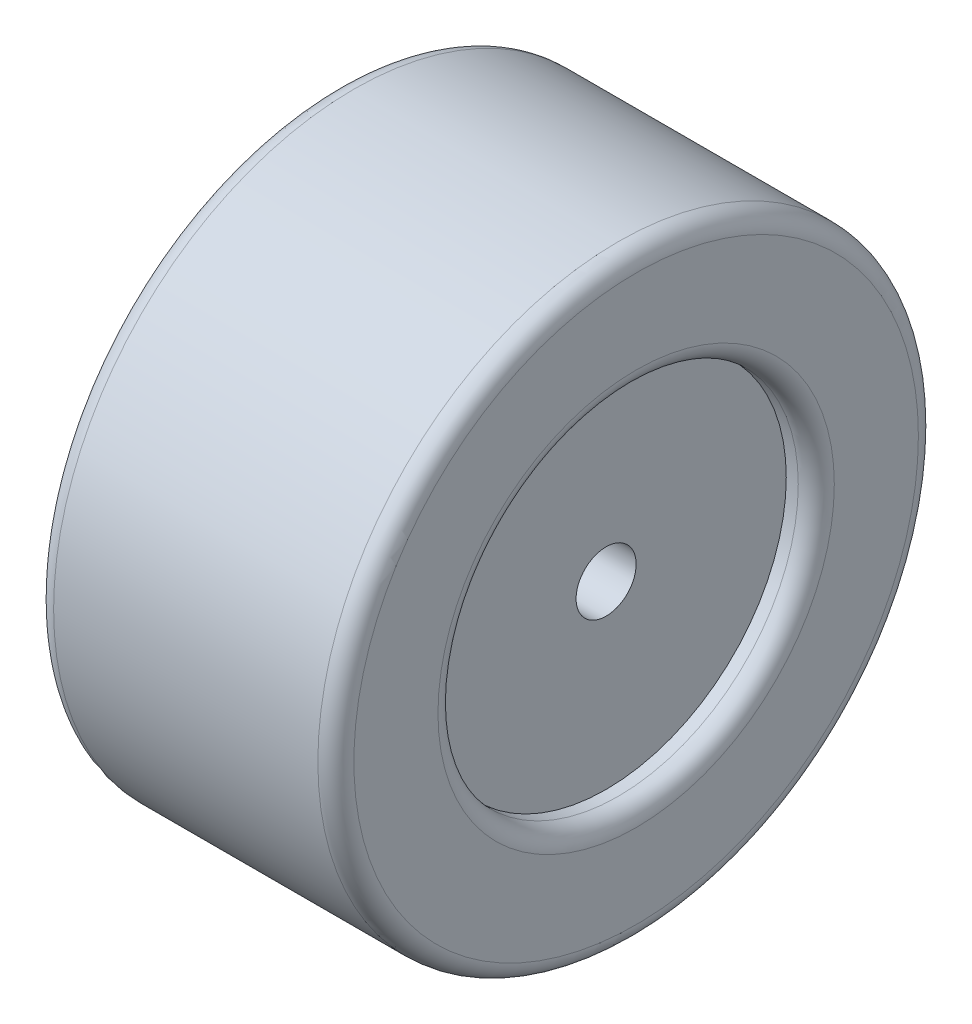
from build123d import *

# Parameters (mm, degrees)
ESQUISSE1_R             = 5
ESQUISSE1_R_2           = 0.5
BOSS_EXTRU_1_DEPTH      = 5
ESQUISSE2_R             = 3
ENL_V_MAT_EXTRU_1_DEPTH = 0.5
ENL_V_START             = -0.5
ESQUISSE3_R             = 3
ENL_V_MAT_EXTRU_2_DEPTH = 0.5
CONG_1_R                = 0.3


with BuildPart() as part:
    # Esquisse1 → Boss.-Extru.1 (new body)
    with BuildSketch(Plane(origin=(0, 0, 0), x_dir=(0, 0, -1), z_dir=(1, 0, 0))):
        Circle(ESQUISSE1_R)
        Circle(ESQUISSE1_R_2, mode=Mode.SUBTRACT)
    extrude(amount=BOSS_EXTRU_1_DEPTH)

    # Esquisse2 → Enl_v. mat.-Extru.1 (cut)
    with BuildSketch(Plane(origin=(5, 0, 0), x_dir=(0, 0, -1), z_dir=(1, 0, 0))):
        Circle(ESQUISSE2_R)
    extrude(amount=-ENL_V_MAT_EXTRU_1_DEPTH, mode=Mode.SUBTRACT)

    # Esquisse3 → Enl_v. mat.-Extru.2 (cut)
    with BuildSketch(Plane.ZY.offset(ENL_V_START)):
        with Locations(Location((0, 0, 0), (0, 0, 180))):
            Circle(ESQUISSE3_R)
    extrude(amount=ENL_V_MAT_EXTRU_2_DEPTH, mode=Mode.SUBTRACT)

    # Cong_1
    cong_1_edges = [part.edges().sort_by_distance(p)[0] for p in [
        (5, 0, 3),
        (0, 0, 3),
        (0, 0, 5),
        (5, 0, 5),
    ]]
    fillet(cong_1_edges, radius=CONG_1_R)


solid = part.part
